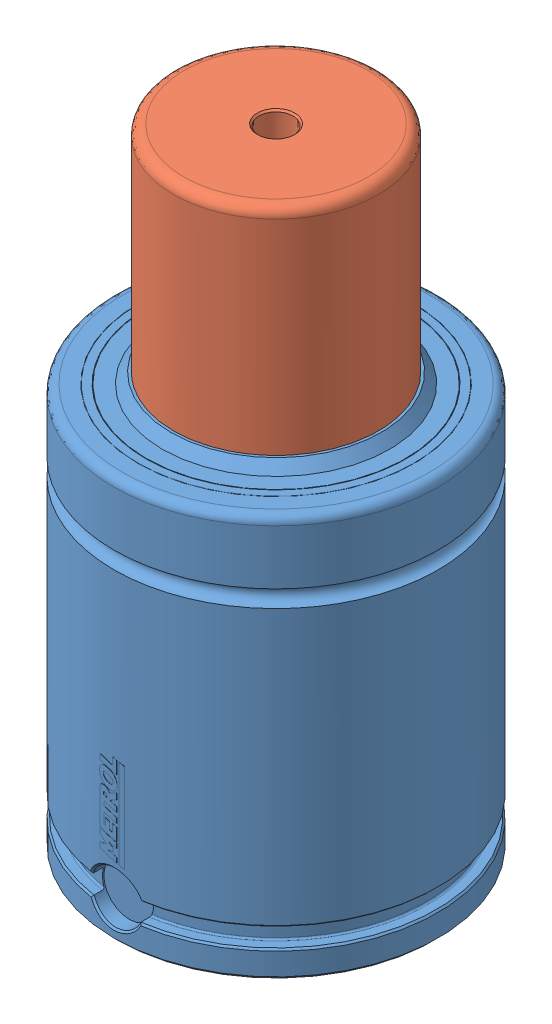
SolidWorks assembly EX4200-063.SLDASM, configuration Default (file format 7000). Lengths in mm.
Overall size (106.57 184 106.57).
2 component instances, 2 part files, 5 mates.
Components (placement in the parent):
- EX4200 Body-1: EX4200 Body.SLDPRT [EX-4200-063] x (0 0 1) z (0 -1 0) size (95.1 95 121)
- EX4200 Piston-1: EX4200 Piston.SLDPRT [EX-4200-063] at (0 103 0) x (-0.42872 0 -0.903437) z (0 -1 0) size (80 80 81)
Mates (geometry in assembly coordinates):
- Concentric1: concentric aligned: cylinder of EX4200 Body-1 through (0 0 0) axis (0 -1 0) radius 30; cylinder of EX4200 Piston-1 through (0 103 0) axis (0 -1 0) radius 30
- LimitDistance1: limit distance anti-aligned: plane of EX4200 Body-1 through (-30 108 0) normal (0 -1 0); plane of EX4200 Piston-1 through (36.1375 108 -17.1488) normal (0 1 0)
- Coincident1: coincident anti-aligned: plane of EX4200 Body-1 through (0 0 0) normal (0 -1 0); plane of assembly through (0 0 0) normal (0 1 0)
- Coincident2: coincident aligned: plane of EX4200 Body-1; plane of assembly through (0 0 0) normal (0 0 1)
- Coincident3: coincident anti-aligned: plane of EX4200 Body-1; plane of assembly through (0 0 0) normal (1 0 0)
